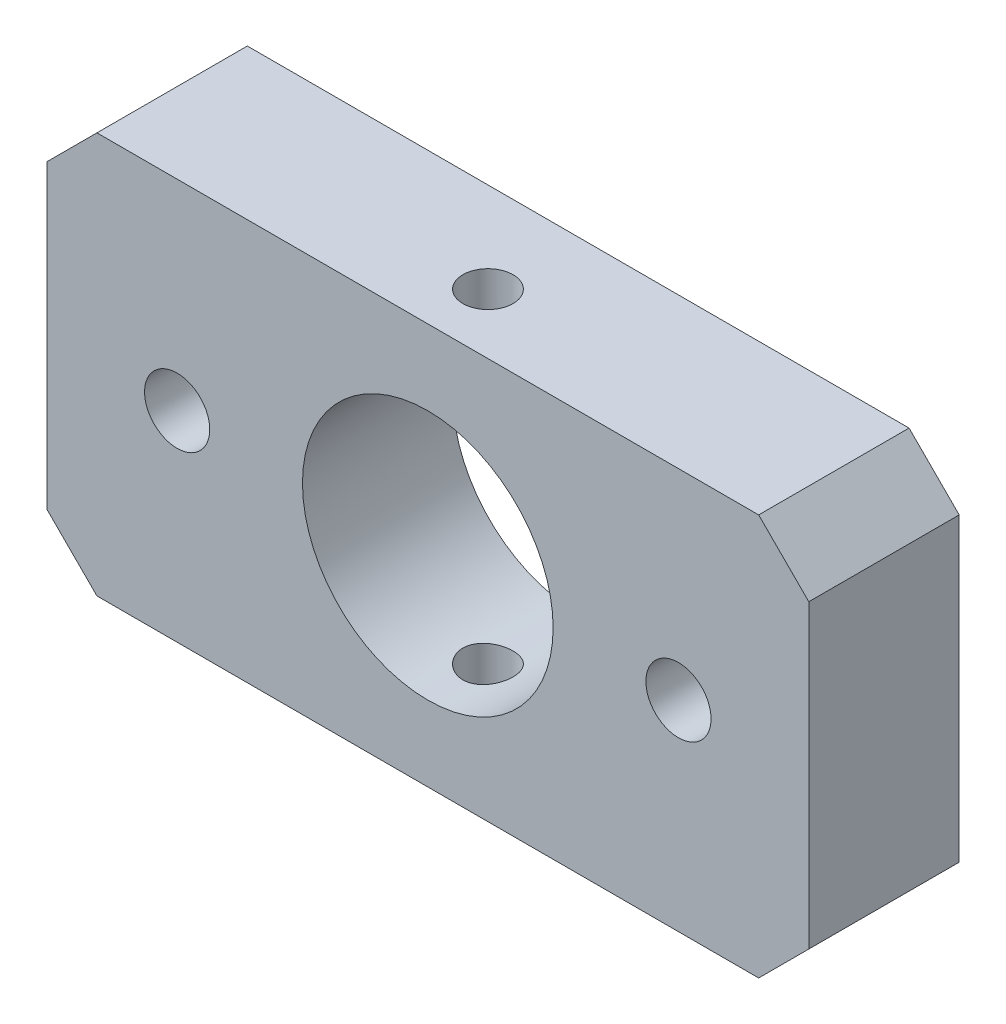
from build123d import *

# Parameters (mm, degrees)
ESQUISSE1_W             = 76
ESQUISSE1_H             = 40
EXTRUSION1_DEPTH        = 15
ESQUISSE2_R             = 12.5
ENL_V_MAT_EXTRU_1_DEPTH = 15
ESQUISSE3_R             = 3.25
ENL_V_MAT_EXTRU_2_DEPTH = 15
CHANFREIN1_SIZE         = 5
ESQUISSE4_R             = 2.5
ENL_V_MAT_EXTRU_3_DEPTH = 53.277027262


with BuildPart() as part:
    # Esquisse1 → Extrusion1 (new body)
    with BuildSketch(Plane.XY):
        Rectangle(ESQUISSE1_W, ESQUISSE1_H)
    extrude(amount=EXTRUSION1_DEPTH)

    # Esquisse2 → Enl_v. mat.-Extru.1 (cut)
    with BuildSketch(Plane.XY.offset(15)):
        Circle(ESQUISSE2_R)
    extrude(amount=-ENL_V_MAT_EXTRU_1_DEPTH, mode=Mode.SUBTRACT)

    # Esquisse3 → Enl_v. mat.-Extru.2 (cut)
    with BuildSketch(Plane.XY.offset(15)):
        with Locations((25, 0)):
            Circle(ESQUISSE3_R)
        with Locations((-25, 0)):
            Circle(ESQUISSE3_R)
    extrude(amount=-ENL_V_MAT_EXTRU_2_DEPTH, mode=Mode.SUBTRACT)

    # Chanfrein1
    chanfrein1_edges = [part.edges().sort_by_distance(p)[0] for p in [
        (-38, 20, 7.5),
        (38, 20, 7.5),
        (38, -20, 7.5),
        (-38, -20, 7.5),
    ]]
    chamfer(chanfrein1_edges, length=CHANFREIN1_SIZE)

    # Esquisse4 → Enl_v. mat.-Extru.3 (cut)
    with BuildSketch(Plane(origin=(0, 20, 0), x_dir=(-1, 0, 0), z_dir=(0, 1, 0))):
        with Locations(Location((0, 9, 0), (0, 0, 90))):
            Circle(ESQUISSE4_R)
    extrude(amount=-ENL_V_MAT_EXTRU_3_DEPTH, mode=Mode.SUBTRACT)


solid = part.part
